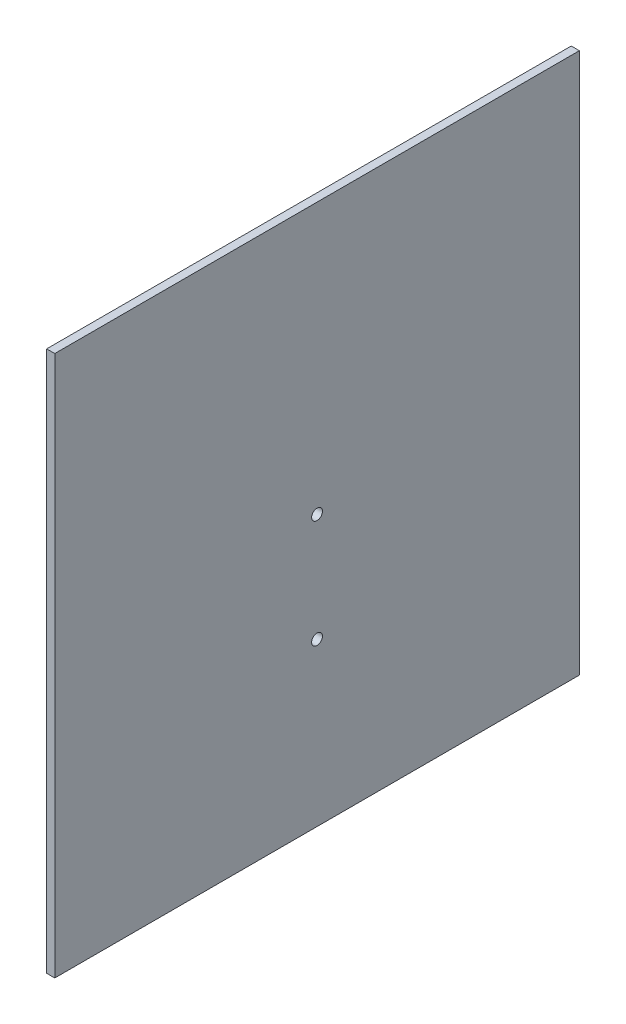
from build123d import *

# Parameters (mm, degrees)
SKIZZE1_W                       = 194
SKIZZE1_H                       = 200
LINEAR_AUSTRAGEN1_DEPTH         = 3
SKIZZE2_R                       = 2
SCHNITT_LINEAR_AUSTRAGEN1_DEPTH = 20
SKIZZE3_R                       = 2
SCHNITT_LINEAR_AUSTRAGEN2_DEPTH = 20


with BuildPart() as part:
    # Skizze1 → Linear austragen1 (new body)
    with BuildSketch(Plane(origin=(0, 0, 0), x_dir=(0, 0, -1), z_dir=(1, 0, 0))):
        Rectangle(SKIZZE1_W, SKIZZE1_H)
    extrude(amount=LINEAR_AUSTRAGEN1_DEPTH)

    # Skizze2 → Schnitt-Linear austragen1 (cut)
    with BuildSketch(Plane(origin=(3, 0, 0), x_dir=(0, 0, -1), z_dir=(1, 0, 0))):
        Circle(SKIZZE2_R)
    extrude(amount=-SCHNITT_LINEAR_AUSTRAGEN1_DEPTH, mode=Mode.SUBTRACT)

    # Skizze3 → Schnitt-Linear austragen2 (cut)
    with BuildSketch(Plane(origin=(3, 0, 0), x_dir=(0, 0, -1), z_dir=(1, 0, 0))):
        with Locations((0, -40)):
            Circle(SKIZZE3_R)
    extrude(amount=-SCHNITT_LINEAR_AUSTRAGEN2_DEPTH, mode=Mode.SUBTRACT)


solid = part.part
